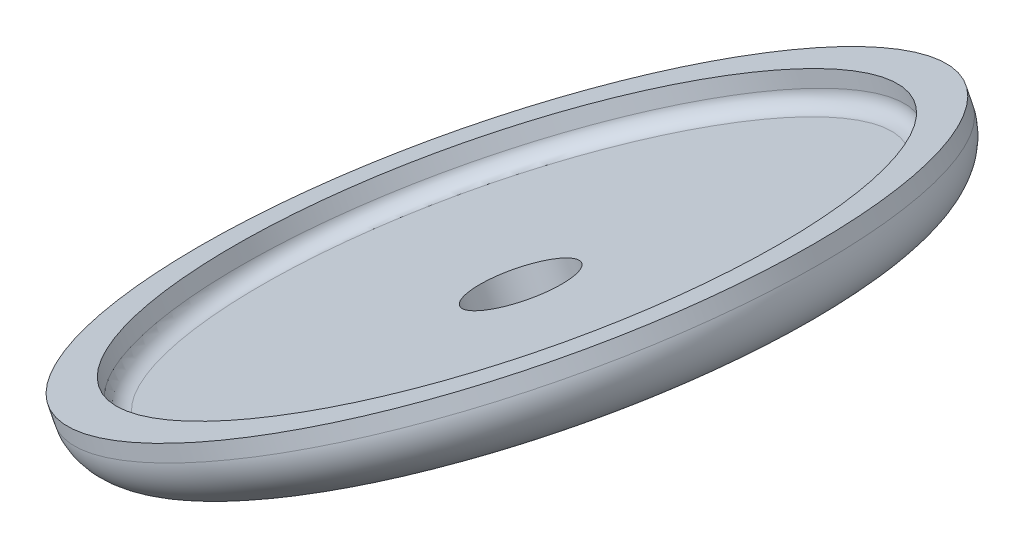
ISO-10303-21;
HEADER;
FILE_DESCRIPTION(('STEP AP214'),'2;1');
FILE_NAME('part.step','',(''),(''),'','','');
FILE_SCHEMA(('AUTOMOTIVE_DESIGN { 1 0 10303 214 1 1 1 1 }'));
ENDSEC;
DATA;
#1=APPLICATION_CONTEXT('core data for automotive mechanical design processes');
#2=APPLICATION_PROTOCOL_DEFINITION('international standard','automotive_design',2000,#1);
#3=PRODUCT_CONTEXT('',#1,'mechanical');
#4=PRODUCT('Part','Part','',(#3));
#5=PRODUCT_RELATED_PRODUCT_CATEGORY('part','',(#4));
#6=PRODUCT_DEFINITION_FORMATION('','',#4);
#7=PRODUCT_DEFINITION_CONTEXT('part definition',#1,'design');
#8=PRODUCT_DEFINITION('design','',#6,#7);
#9=PRODUCT_DEFINITION_SHAPE('','',#8);
#10=(LENGTH_UNIT() NAMED_UNIT(*) SI_UNIT(.MILLI.,.METRE.));
#11=(NAMED_UNIT(*) PLANE_ANGLE_UNIT() SI_UNIT($,.RADIAN.));
#12=(NAMED_UNIT(*) SI_UNIT($,.STERADIAN.) SOLID_ANGLE_UNIT());
#13=UNCERTAINTY_MEASURE_WITH_UNIT(LENGTH_MEASURE(1.E-05),#10,'distance_accuracy_value','');
#14=(GEOMETRIC_REPRESENTATION_CONTEXT(3) GLOBAL_UNCERTAINTY_ASSIGNED_CONTEXT((#13)) GLOBAL_UNIT_ASSIGNED_CONTEXT((#10,
#11,#12)) REPRESENTATION_CONTEXT('',''));
#15=CARTESIAN_POINT('',(0.,0.,0.));
#16=DIRECTION('',(0.,0.,1.));
#17=DIRECTION('',(1.,0.,0.));
#18=AXIS2_PLACEMENT_3D('',#15,#16,#17);
#19=CARTESIAN_POINT('',(-18.4243817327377,113.595700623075,0.));
#20=DIRECTION('',(0.449375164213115,-0.893343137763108,0.));
#21=DIRECTION('',(0.893343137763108,0.449375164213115,0.));
#22=AXIS2_PLACEMENT_3D('',#19,#20,#21);
#23=TOROIDAL_SURFACE('',#22,19.5,3.);
#24=CARTESIAN_POINT('',(-18.4243817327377,113.595700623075,0.));
#25=DIRECTION('',(0.449375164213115,-0.893343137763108,0.));
#26=DIRECTION('',(0.893343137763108,0.449375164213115,0.));
#27=AXIS2_PLACEMENT_3D('',#24,#25,#26);
#28=CIRCLE('',#27,22.5);
#29=CARTESIAN_POINT('',(1.6758388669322,123.70664181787,0.));
#30=VERTEX_POINT('',#29);
#31=EDGE_CURVE('E394',#30,#30,#28,.T.);
#32=ORIENTED_EDGE('',*,*,#31,.T.);
#33=EDGE_LOOP('',(#32));
#34=FACE_BOUND('',#33,.T.);
#35=CARTESIAN_POINT('',(-17.0762562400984,110.915671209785,0.));
#36=DIRECTION('',(0.449375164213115,-0.893343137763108,0.));
#37=DIRECTION('',(0.893343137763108,0.449375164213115,0.));
#38=AXIS2_PLACEMENT_3D('',#35,#36,#37);
#39=CIRCLE('',#38,19.5);
#40=CARTESIAN_POINT('',(0.343934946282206,119.678486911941,0.));
#41=VERTEX_POINT('',#40);
#42=EDGE_CURVE('E10',#41,#41,#39,.T.);
#43=ORIENTED_EDGE('',*,*,#42,.F.);
#44=EDGE_LOOP('',(#43));
#45=FACE_BOUND('',#44,.T.);
#46=ADVANCED_FACE('F366',(#34,#45),#23,.T.);
#47=CARTESIAN_POINT('',(-14.3962268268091,112.263796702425,0.));
#48=DIRECTION('',(0.449375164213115,-0.893343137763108,0.));
#49=DIRECTION('',(0.893343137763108,0.449375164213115,0.));
#50=AXIS2_PLACEMENT_3D('',#47,#48,#49);
#51=PLANE('',#50);
#52=ORIENTED_EDGE('',*,*,#42,.T.);
#53=EDGE_LOOP('',(#52));
#54=FACE_BOUND('',#53,.T.);
#55=CARTESIAN_POINT('',(-17.0762562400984,110.915671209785,0.));
#56=DIRECTION('',(0.449375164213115,-0.893343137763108,0.));
#57=DIRECTION('',(0.893343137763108,0.449375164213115,0.));
#58=AXIS2_PLACEMENT_3D('',#55,#56,#57);
#59=CIRCLE('',#58,3.00000000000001);
#60=CARTESIAN_POINT('',(-14.3962268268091,112.263796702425,0.));
#61=VERTEX_POINT('',#60);
#62=EDGE_CURVE('E372',#61,#61,#59,.T.);
#63=ORIENTED_EDGE('',*,*,#62,.F.);
#64=EDGE_LOOP('',(#63));
#65=FACE_BOUND('',#64,.T.);
#66=ADVANCED_FACE('F412',(#54,#65),#51,.T.);
#67=CARTESIAN_POINT('',(18.8737568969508,39.4482201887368,0.));
#68=DIRECTION('',(0.449375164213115,-0.893343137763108,0.));
#69=DIRECTION('',(0.893343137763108,0.449375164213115,0.));
#70=AXIS2_PLACEMENT_3D('',#67,#68,#69);
#71=CYLINDRICAL_SURFACE('',#70,3.);
#72=ORIENTED_EDGE('',*,*,#62,.T.);
#73=EDGE_LOOP('',(#72));
#74=FACE_BOUND('',#73,.T.);
#75=CARTESIAN_POINT('',(-17.9750065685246,112.702357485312,0.));
#76=DIRECTION('',(0.449375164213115,-0.893343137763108,0.));
#77=DIRECTION('',(0.893343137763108,0.449375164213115,0.));
#78=AXIS2_PLACEMENT_3D('',#75,#76,#77);
#79=CIRCLE('',#78,3.);
#80=CARTESIAN_POINT('',(-15.2949771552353,114.050482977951,0.));
#81=VERTEX_POINT('',#80);
#82=EDGE_CURVE('E376',#81,#81,#79,.T.);
#83=ORIENTED_EDGE('',*,*,#82,.F.);
#84=EDGE_LOOP('',(#83));
#85=FACE_BOUND('',#84,.T.);
#86=ADVANCED_FACE('F416',(#74,#85),#71,.F.);
#87=CARTESIAN_POINT('',(-1.00148695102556,121.240485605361,0.));
#88=DIRECTION('',(-0.449375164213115,0.893343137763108,0.));
#89=DIRECTION('',(-0.893343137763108,-0.449375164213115,0.));
#90=AXIS2_PLACEMENT_3D('',#87,#88,#89);
#91=PLANE('',#90);
#92=ORIENTED_EDGE('',*,*,#82,.T.);
#93=EDGE_LOOP('',(#92));
#94=FACE_BOUND('',#93,.T.);
#95=CARTESIAN_POINT('',(-17.9750065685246,112.702357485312,0.));
#96=DIRECTION('',(0.449375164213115,-0.893343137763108,0.));
#97=DIRECTION('',(0.893343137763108,0.449375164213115,0.));
#98=AXIS2_PLACEMENT_3D('',#95,#96,#97);
#99=CIRCLE('',#98,19.);
#100=CARTESIAN_POINT('',(-1.00148695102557,121.240485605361,0.));
#101=VERTEX_POINT('',#100);
#102=EDGE_CURVE('E380',#101,#101,#99,.T.);
#103=ORIENTED_EDGE('',*,*,#102,.F.);
#104=EDGE_LOOP('',(#103));
#105=FACE_BOUND('',#104,.T.);
#106=ADVANCED_FACE('F420',(#94,#105),#91,.T.);
#107=CARTESIAN_POINT('',(-18.4243817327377,113.595700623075,0.));
#108=DIRECTION('',(0.449375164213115,-0.893343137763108,0.));
#109=DIRECTION('',(0.893343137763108,0.449375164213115,0.));
#110=AXIS2_PLACEMENT_3D('',#107,#108,#109);
#111=TOROIDAL_SURFACE('',#110,19.,1.00000000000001);
#112=ORIENTED_EDGE('',*,*,#102,.T.);
#113=EDGE_LOOP('',(#112));
#114=FACE_BOUND('',#113,.T.);
#115=CARTESIAN_POINT('',(-18.4243817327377,113.595700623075,0.));
#116=DIRECTION('',(0.449375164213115,-0.893343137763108,0.));
#117=DIRECTION('',(0.893343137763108,0.449375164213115,0.));
#118=AXIS2_PLACEMENT_3D('',#115,#116,#117);
#119=CIRCLE('',#118,20.);
#120=CARTESIAN_POINT('',(-0.557518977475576,122.583203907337,0.));
#121=VERTEX_POINT('',#120);
#122=EDGE_CURVE('E385',#121,#121,#119,.T.);
#123=ORIENTED_EDGE('',*,*,#122,.F.);
#124=EDGE_LOOP('',(#123));
#125=FACE_BOUND('',#124,.T.);
#126=ADVANCED_FACE('F426',(#114,#125),#111,.F.);
#127=CARTESIAN_POINT('',(18.8737568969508,39.4482201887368,0.));
#128=DIRECTION('',(0.449375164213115,-0.893343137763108,0.));
#129=DIRECTION('',(0.893343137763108,0.449375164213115,0.));
#130=AXIS2_PLACEMENT_3D('',#127,#128,#129);
#131=CYLINDRICAL_SURFACE('',#130,20.);
#132=ORIENTED_EDGE('',*,*,#122,.T.);
#133=EDGE_LOOP('',(#132));
#134=FACE_BOUND('',#133,.T.);
#135=CARTESIAN_POINT('',(-18.8737568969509,114.489043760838,0.));
#136=DIRECTION('',(0.449375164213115,-0.893343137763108,0.));
#137=DIRECTION('',(0.893343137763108,0.449375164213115,0.));
#138=AXIS2_PLACEMENT_3D('',#135,#136,#137);
#139=CIRCLE('',#138,20.);
#140=CARTESIAN_POINT('',(-1.00689414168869,123.4765470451,0.));
#141=VERTEX_POINT('',#140);
#142=EDGE_CURVE('E388',#141,#141,#139,.T.);
#143=ORIENTED_EDGE('',*,*,#142,.F.);
#144=EDGE_LOOP('',(#143));
#145=FACE_BOUND('',#144,.T.);
#146=ADVANCED_FACE('F408',(#134,#145),#131,.F.);
#147=CARTESIAN_POINT('',(1.22646370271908,124.599984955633,0.));
#148=DIRECTION('',(-0.449375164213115,0.893343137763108,0.));
#149=DIRECTION('',(-0.893343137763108,-0.449375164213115,0.));
#150=AXIS2_PLACEMENT_3D('',#147,#148,#149);
#151=PLANE('',#150);
#152=ORIENTED_EDGE('',*,*,#142,.T.);
#153=EDGE_LOOP('',(#152));
#154=FACE_BOUND('',#153,.T.);
#155=CARTESIAN_POINT('',(-18.8737568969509,114.489043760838,0.));
#156=DIRECTION('',(0.449375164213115,-0.893343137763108,0.));
#157=DIRECTION('',(0.893343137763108,0.449375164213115,0.));
#158=AXIS2_PLACEMENT_3D('',#155,#156,#157);
#159=CIRCLE('',#158,22.5);
#160=CARTESIAN_POINT('',(1.22646370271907,124.599984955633,0.));
#161=VERTEX_POINT('',#160);
#162=EDGE_CURVE('E391',#161,#161,#159,.T.);
#163=ORIENTED_EDGE('',*,*,#162,.F.);
#164=EDGE_LOOP('',(#163));
#165=FACE_BOUND('',#164,.T.);
#166=ADVANCED_FACE('F402',(#154,#165),#151,.T.);
#167=CARTESIAN_POINT('',(18.8737568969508,39.4482201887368,0.));
#168=DIRECTION('',(0.449375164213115,-0.893343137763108,0.));
#169=DIRECTION('',(0.893343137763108,0.449375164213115,0.));
#170=AXIS2_PLACEMENT_3D('',#167,#168,#169);
#171=CYLINDRICAL_SURFACE('',#170,22.5);
#172=ORIENTED_EDGE('',*,*,#162,.T.);
#173=EDGE_LOOP('',(#172));
#174=FACE_BOUND('',#173,.T.);
#175=ORIENTED_EDGE('',*,*,#31,.F.);
#176=EDGE_LOOP('',(#175));
#177=FACE_BOUND('',#176,.T.);
#178=ADVANCED_FACE('F400',(#174,#177),#171,.T.);
#179=CLOSED_SHELL('',(#46,#66,#86,#106,#126,#146,#166,#178));
#180=MANIFOLD_SOLID_BREP('B2',#179);
#181=ADVANCED_BREP_SHAPE_REPRESENTATION('',(#18,#180),#14);
#182=SHAPE_DEFINITION_REPRESENTATION(#9,#181);
ENDSEC;
END-ISO-10303-21;
